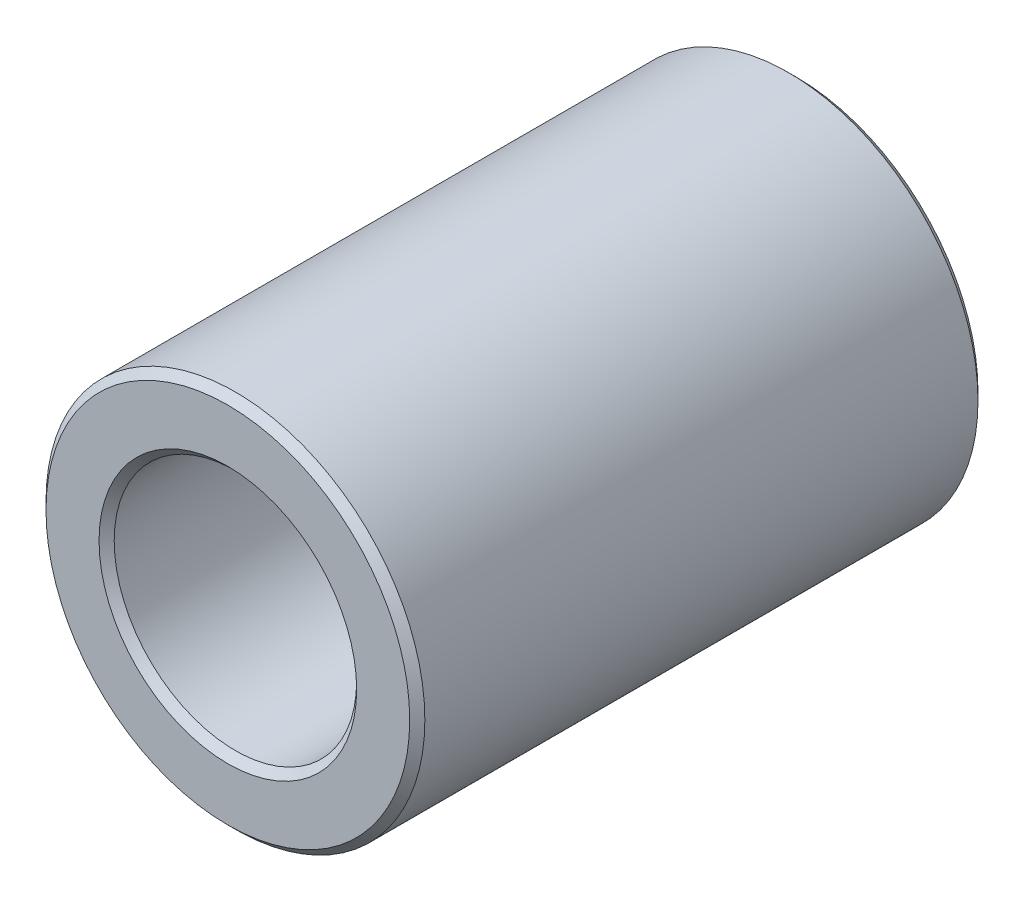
from build123d import *

# Parameters (mm, degrees)
SKETCH1_R           = 5
SKETCH1_R_2         = 3.2
BOSS_EXTRUDE2_DEPTH = 7.5
CHAMFER3_SIZE       = 0.2


with BuildPart() as part:
    # Sketch1 → Boss-Extrude2 (new, symmetric)
    with BuildSketch(Plane.XY):
        Circle(SKETCH1_R)
        Circle(SKETCH1_R_2, mode=Mode.SUBTRACT)
    extrude(amount=BOSS_EXTRUDE2_DEPTH, both=True)

    # Chamfer3
    chamfer3_edges = [part.edges().sort_by_distance(p)[0] for p in [
        (-5, 0, -7.5),
        (-5, 0, 7.5),
        (-3.2, 0, -7.5),
        (-3.2, 0, 7.5),
    ]]
    chamfer(chamfer3_edges, length=CHAMFER3_SIZE)


solid = part.part
